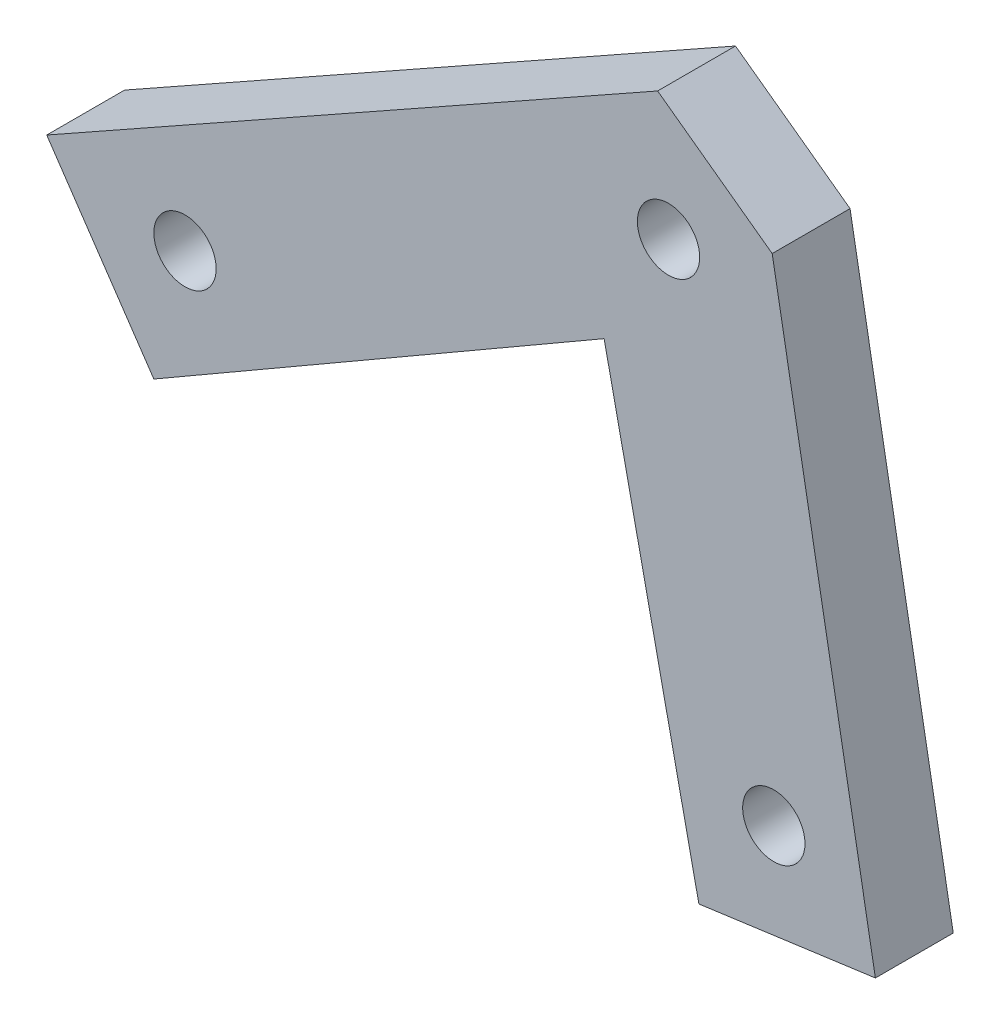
ISO-10303-21;
HEADER;
FILE_DESCRIPTION(('STEP AP214'),'2;1');
FILE_NAME('part.step','',(''),(''),'','','');
FILE_SCHEMA(('AUTOMOTIVE_DESIGN { 1 0 10303 214 1 1 1 1 }'));
ENDSEC;
DATA;
#1=APPLICATION_CONTEXT('core data for automotive mechanical design processes');
#2=APPLICATION_PROTOCOL_DEFINITION('international standard','automotive_design',2000,#1);
#3=PRODUCT_CONTEXT('',#1,'mechanical');
#4=PRODUCT('Part','Part','',(#3));
#5=PRODUCT_RELATED_PRODUCT_CATEGORY('part','',(#4));
#6=PRODUCT_DEFINITION_FORMATION('','',#4);
#7=PRODUCT_DEFINITION_CONTEXT('part definition',#1,'design');
#8=PRODUCT_DEFINITION('design','',#6,#7);
#9=PRODUCT_DEFINITION_SHAPE('','',#8);
#10=(LENGTH_UNIT() NAMED_UNIT(*) SI_UNIT(.MILLI.,.METRE.));
#11=(NAMED_UNIT(*) PLANE_ANGLE_UNIT() SI_UNIT($,.RADIAN.));
#12=(NAMED_UNIT(*) SI_UNIT($,.STERADIAN.) SOLID_ANGLE_UNIT());
#13=UNCERTAINTY_MEASURE_WITH_UNIT(LENGTH_MEASURE(1.E-05),#10,'distance_accuracy_value','');
#14=(GEOMETRIC_REPRESENTATION_CONTEXT(3) GLOBAL_UNCERTAINTY_ASSIGNED_CONTEXT((#13)) GLOBAL_UNIT_ASSIGNED_CONTEXT((#10,
#11,#12)) REPRESENTATION_CONTEXT('',''));
#15=CARTESIAN_POINT('',(0.,0.,0.));
#16=DIRECTION('',(0.,0.,1.));
#17=DIRECTION('',(1.,0.,0.));
#18=AXIS2_PLACEMENT_3D('',#15,#16,#17);
#19=CARTESIAN_POINT('',(0.,0.,6.35));
#20=DIRECTION('',(0.,0.,1.));
#21=DIRECTION('',(1.,0.,0.));
#22=AXIS2_PLACEMENT_3D('',#19,#20,#21);
#23=PLANE('',#22);
#24=CARTESIAN_POINT('',(12.9301314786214,13.5051717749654,6.35));
#25=DIRECTION('',(0.,0.,1.));
#26=DIRECTION('',(1.,0.,0.));
#27=AXIS2_PLACEMENT_3D('',#24,#25,#26);
#28=CIRCLE('',#27,2.54);
#29=CARTESIAN_POINT('',(15.4701314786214,13.5051717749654,6.35));
#30=VERTEX_POINT('',#29);
#31=EDGE_CURVE('E164',#30,#30,#28,.T.);
#32=ORIENTED_EDGE('',*,*,#31,.F.);
#33=EDGE_LOOP('',(#32));
#34=FACE_BOUND('',#33,.T.);
#35=DIRECTION('',(-0.871585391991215,-0.490243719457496,0.));
#36=VECTOR('',#35,1.);
#37=CARTESIAN_POINT('',(12.0429958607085,23.5374237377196,6.35));
#38=LINE('',#37,#36);
#39=CARTESIAN_POINT('',(12.0429958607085,23.5374237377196,6.35));
#40=VERTEX_POINT('',#39);
#41=CARTESIAN_POINT('',(-37.7708753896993,-4.48156068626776,6.35));
#42=VERTEX_POINT('',#41);
#43=EDGE_CURVE('E137',#40,#42,#38,.T.);
#44=ORIENTED_EDGE('',*,*,#43,.T.);
#45=DIRECTION('',(0.561707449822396,-0.827335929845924,0.));
#46=VECTOR('',#45,1.);
#47=CARTESIAN_POINT('',(-37.7708753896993,-4.48156068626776,6.35));
#48=LINE('',#47,#46);
#49=CARTESIAN_POINT('',(-29.0364554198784,-17.3464416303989,6.35));
#50=VERTEX_POINT('',#49);
#51=EDGE_CURVE('E90',#42,#50,#48,.T.);
#52=ORIENTED_EDGE('',*,*,#51,.T.);
#53=DIRECTION('',(0.865901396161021,0.500214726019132,0.));
#54=VECTOR('',#53,1.);
#55=CARTESIAN_POINT('',(-29.0364554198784,-17.3464416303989,6.35));
#56=LINE('',#55,#54);
#57=CARTESIAN_POINT('',(7.68011087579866,3.86401862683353,6.35));
#58=VERTEX_POINT('',#57);
#59=EDGE_CURVE('E149',#50,#58,#56,.T.);
#60=ORIENTED_EDGE('',*,*,#59,.T.);
#61=DIRECTION('',(0.209529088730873,-0.977802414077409,0.));
#62=VECTOR('',#61,1.);
#63=CARTESIAN_POINT('',(7.68011087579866,3.86401862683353,6.35));
#64=LINE('',#63,#62);
#65=CARTESIAN_POINT('',(15.4067785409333,-32.1937638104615,6.35));
#66=VERTEX_POINT('',#65);
#67=EDGE_CURVE('E106',#58,#66,#64,.T.);
#68=ORIENTED_EDGE('',*,*,#67,.T.);
#69=DIRECTION('',(0.990766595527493,0.135578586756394,0.));
#70=VECTOR('',#69,1.);
#71=CARTESIAN_POINT('',(15.4067785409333,-32.1937638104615,6.35));
#72=LINE('',#71,#70);
#73=CARTESIAN_POINT('',(29.799590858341,-30.2242210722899,6.35));
#74=VERTEX_POINT('',#73);
#75=EDGE_CURVE('E100',#66,#74,#72,.T.);
#76=ORIENTED_EDGE('',*,*,#75,.T.);
#77=DIRECTION('',(-0.176427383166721,0.984313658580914,0.));
#78=VECTOR('',#77,1.);
#79=CARTESIAN_POINT('',(29.799590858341,-30.2242210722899,6.35));
#80=LINE('',#79,#78);
#81=CARTESIAN_POINT('',(21.3841908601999,16.7265017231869,6.35));
#82=VERTEX_POINT('',#81);
#83=EDGE_CURVE('E104',#74,#82,#80,.T.);
#84=ORIENTED_EDGE('',*,*,#83,.T.);
#85=DIRECTION('',(-0.808022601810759,0.589151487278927,0.));
#86=VECTOR('',#85,1.);
#87=CARTESIAN_POINT('',(21.3841908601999,16.7265017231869,6.35));
#88=LINE('',#87,#86);
#89=EDGE_CURVE('E50',#82,#40,#88,.T.);
#90=ORIENTED_EDGE('',*,*,#89,.T.);
#91=EDGE_LOOP('',(#44,#52,#60,#68,#76,#84,#90));
#92=FACE_BOUND('',#91,.T.);
#93=CARTESIAN_POINT('',(-26.4964554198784,-7.02156068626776,6.35));
#94=DIRECTION('',(0.,0.,1.));
#95=DIRECTION('',(1.,0.,0.));
#96=AXIS2_PLACEMENT_3D('',#93,#94,#95);
#97=CIRCLE('',#96,2.54);
#98=CARTESIAN_POINT('',(-23.9564554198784,-7.02156068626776,6.35));
#99=VERTEX_POINT('',#98);
#100=EDGE_CURVE('E128',#99,#99,#97,.T.);
#101=ORIENTED_EDGE('',*,*,#100,.F.);
#102=EDGE_LOOP('',(#101));
#103=FACE_BOUND('',#102,.T.);
#104=CARTESIAN_POINT('',(21.5172256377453,-23.6145239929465,6.35));
#105=DIRECTION('',(0.,0.,1.));
#106=DIRECTION('',(1.,0.,0.));
#107=AXIS2_PLACEMENT_3D('',#104,#105,#106);
#108=CIRCLE('',#107,2.54);
#109=CARTESIAN_POINT('',(24.0572256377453,-23.6145239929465,6.35));
#110=VERTEX_POINT('',#109);
#111=EDGE_CURVE('E170',#110,#110,#108,.T.);
#112=ORIENTED_EDGE('',*,*,#111,.F.);
#113=EDGE_LOOP('',(#112));
#114=FACE_BOUND('',#113,.T.);
#115=ADVANCED_FACE('F33',(#34,#92,#103,#114),#23,.T.);
#116=CARTESIAN_POINT('',(0.,0.,0.));
#117=DIRECTION('',(0.,0.,1.));
#118=DIRECTION('',(1.,0.,0.));
#119=AXIS2_PLACEMENT_3D('',#116,#117,#118);
#120=PLANE('',#119);
#121=CARTESIAN_POINT('',(12.9301314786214,13.5051717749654,0.));
#122=DIRECTION('',(0.,0.,1.));
#123=DIRECTION('',(1.,0.,0.));
#124=AXIS2_PLACEMENT_3D('',#121,#122,#123);
#125=CIRCLE('',#124,2.54);
#126=CARTESIAN_POINT('',(15.4701314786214,13.5051717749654,0.));
#127=VERTEX_POINT('',#126);
#128=EDGE_CURVE('E167',#127,#127,#125,.T.);
#129=ORIENTED_EDGE('',*,*,#128,.T.);
#130=EDGE_LOOP('',(#129));
#131=FACE_BOUND('',#130,.T.);
#132=DIRECTION('',(-0.871585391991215,-0.490243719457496,0.));
#133=VECTOR('',#132,1.);
#134=CARTESIAN_POINT('',(12.0429958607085,23.5374237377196,0.));
#135=LINE('',#134,#133);
#136=CARTESIAN_POINT('',(12.0429958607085,23.5374237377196,0.));
#137=VERTEX_POINT('',#136);
#138=CARTESIAN_POINT('',(-37.7708753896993,-4.48156068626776,0.));
#139=VERTEX_POINT('',#138);
#140=EDGE_CURVE('E124',#137,#139,#135,.T.);
#141=ORIENTED_EDGE('',*,*,#140,.F.);
#142=DIRECTION('',(-0.808022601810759,0.589151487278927,0.));
#143=VECTOR('',#142,1.);
#144=CARTESIAN_POINT('',(21.3841908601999,16.7265017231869,0.));
#145=LINE('',#144,#143);
#146=CARTESIAN_POINT('',(21.3841908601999,16.7265017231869,0.));
#147=VERTEX_POINT('',#146);
#148=EDGE_CURVE('E82',#147,#137,#145,.T.);
#149=ORIENTED_EDGE('',*,*,#148,.F.);
#150=DIRECTION('',(-0.176427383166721,0.984313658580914,0.));
#151=VECTOR('',#150,1.);
#152=CARTESIAN_POINT('',(29.799590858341,-30.2242210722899,0.));
#153=LINE('',#152,#151);
#154=CARTESIAN_POINT('',(29.799590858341,-30.2242210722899,0.));
#155=VERTEX_POINT('',#154);
#156=EDGE_CURVE('E76',#155,#147,#153,.T.);
#157=ORIENTED_EDGE('',*,*,#156,.F.);
#158=DIRECTION('',(0.990766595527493,0.135578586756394,0.));
#159=VECTOR('',#158,1.);
#160=CARTESIAN_POINT('',(15.4067785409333,-32.1937638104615,0.));
#161=LINE('',#160,#159);
#162=CARTESIAN_POINT('',(15.4067785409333,-32.1937638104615,0.));
#163=VERTEX_POINT('',#162);
#164=EDGE_CURVE('E114',#163,#155,#161,.T.);
#165=ORIENTED_EDGE('',*,*,#164,.F.);
#166=DIRECTION('',(0.209529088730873,-0.977802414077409,0.));
#167=VECTOR('',#166,1.);
#168=CARTESIAN_POINT('',(7.68011087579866,3.86401862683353,0.));
#169=LINE('',#168,#167);
#170=CARTESIAN_POINT('',(7.68011087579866,3.86401862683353,0.));
#171=VERTEX_POINT('',#170);
#172=EDGE_CURVE('E132',#171,#163,#169,.T.);
#173=ORIENTED_EDGE('',*,*,#172,.F.);
#174=DIRECTION('',(0.865901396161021,0.500214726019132,0.));
#175=VECTOR('',#174,1.);
#176=CARTESIAN_POINT('',(-29.0364554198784,-17.3464416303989,0.));
#177=LINE('',#176,#175);
#178=CARTESIAN_POINT('',(-29.0364554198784,-17.3464416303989,0.));
#179=VERTEX_POINT('',#178);
#180=EDGE_CURVE('E130',#179,#171,#177,.T.);
#181=ORIENTED_EDGE('',*,*,#180,.F.);
#182=DIRECTION('',(0.561707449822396,-0.827335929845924,0.));
#183=VECTOR('',#182,1.);
#184=CARTESIAN_POINT('',(-37.7708753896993,-4.48156068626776,0.));
#185=LINE('',#184,#183);
#186=EDGE_CURVE('E127',#139,#179,#185,.T.);
#187=ORIENTED_EDGE('',*,*,#186,.F.);
#188=EDGE_LOOP('',(#141,#149,#157,#165,#173,#181,#187));
#189=FACE_BOUND('',#188,.T.);
#190=CARTESIAN_POINT('',(-26.4964554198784,-7.02156068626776,0.));
#191=DIRECTION('',(0.,0.,1.));
#192=DIRECTION('',(1.,0.,0.));
#193=AXIS2_PLACEMENT_3D('',#190,#191,#192);
#194=CIRCLE('',#193,2.54);
#195=CARTESIAN_POINT('',(-23.9564554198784,-7.02156068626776,0.));
#196=VERTEX_POINT('',#195);
#197=EDGE_CURVE('E161',#196,#196,#194,.T.);
#198=ORIENTED_EDGE('',*,*,#197,.T.);
#199=EDGE_LOOP('',(#198));
#200=FACE_BOUND('',#199,.T.);
#201=CARTESIAN_POINT('',(21.5172256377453,-23.6145239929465,0.));
#202=DIRECTION('',(0.,0.,1.));
#203=DIRECTION('',(1.,0.,0.));
#204=AXIS2_PLACEMENT_3D('',#201,#202,#203);
#205=CIRCLE('',#204,2.54);
#206=CARTESIAN_POINT('',(24.0572256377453,-23.6145239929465,0.));
#207=VERTEX_POINT('',#206);
#208=EDGE_CURVE('E173',#207,#207,#205,.T.);
#209=ORIENTED_EDGE('',*,*,#208,.T.);
#210=EDGE_LOOP('',(#209));
#211=FACE_BOUND('',#210,.T.);
#212=ADVANCED_FACE('F153',(#131,#189,#200,#211),#120,.F.);
#213=CARTESIAN_POINT('',(12.0429958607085,23.5374237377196,6.35));
#214=DIRECTION('',(0.490243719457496,-0.871585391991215,0.));
#215=DIRECTION('',(0.871585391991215,0.490243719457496,0.));
#216=AXIS2_PLACEMENT_3D('',#213,#214,#215);
#217=PLANE('',#216);
#218=ORIENTED_EDGE('',*,*,#140,.T.);
#219=DIRECTION('',(0.,0.,-1.));
#220=VECTOR('',#219,1.);
#221=CARTESIAN_POINT('',(-37.7708753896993,-4.48156068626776,6.35));
#222=LINE('',#221,#220);
#223=EDGE_CURVE('E11',#42,#139,#222,.T.);
#224=ORIENTED_EDGE('',*,*,#223,.F.);
#225=ORIENTED_EDGE('',*,*,#43,.F.);
#226=DIRECTION('',(0.,0.,-1.));
#227=VECTOR('',#226,1.);
#228=CARTESIAN_POINT('',(12.0429958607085,23.5374237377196,6.35));
#229=LINE('',#228,#227);
#230=EDGE_CURVE('E120',#40,#137,#229,.T.);
#231=ORIENTED_EDGE('',*,*,#230,.T.);
#232=EDGE_LOOP('',(#218,#224,#225,#231));
#233=FACE_BOUND('',#232,.T.);
#234=ADVANCED_FACE('F35',(#233),#217,.F.);
#235=CARTESIAN_POINT('',(-37.7708753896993,-4.48156068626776,6.35));
#236=DIRECTION('',(0.827335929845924,0.561707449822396,0.));
#237=DIRECTION('',(-0.561707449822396,0.827335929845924,0.));
#238=AXIS2_PLACEMENT_3D('',#235,#236,#237);
#239=PLANE('',#238);
#240=ORIENTED_EDGE('',*,*,#186,.T.);
#241=DIRECTION('',(0.,0.,-1.));
#242=VECTOR('',#241,1.);
#243=CARTESIAN_POINT('',(-29.0364554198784,-17.3464416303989,6.35));
#244=LINE('',#243,#242);
#245=EDGE_CURVE('E42',#50,#179,#244,.T.);
#246=ORIENTED_EDGE('',*,*,#245,.F.);
#247=ORIENTED_EDGE('',*,*,#51,.F.);
#248=ORIENTED_EDGE('',*,*,#223,.T.);
#249=EDGE_LOOP('',(#240,#246,#247,#248));
#250=FACE_BOUND('',#249,.T.);
#251=ADVANCED_FACE('F205',(#250),#239,.F.);
#252=CARTESIAN_POINT('',(-29.0364554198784,-17.3464416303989,6.35));
#253=DIRECTION('',(-0.500214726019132,0.865901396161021,0.));
#254=DIRECTION('',(-0.865901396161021,-0.500214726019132,0.));
#255=AXIS2_PLACEMENT_3D('',#252,#253,#254);
#256=PLANE('',#255);
#257=ORIENTED_EDGE('',*,*,#180,.T.);
#258=DIRECTION('',(0.,0.,-1.));
#259=VECTOR('',#258,1.);
#260=CARTESIAN_POINT('',(7.68011087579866,3.86401862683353,6.35));
#261=LINE('',#260,#259);
#262=EDGE_CURVE('E141',#58,#171,#261,.T.);
#263=ORIENTED_EDGE('',*,*,#262,.F.);
#264=ORIENTED_EDGE('',*,*,#59,.F.);
#265=ORIENTED_EDGE('',*,*,#245,.T.);
#266=EDGE_LOOP('',(#257,#263,#264,#265));
#267=FACE_BOUND('',#266,.T.);
#268=ADVANCED_FACE('F147',(#267),#256,.F.);
#269=CARTESIAN_POINT('',(7.68011087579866,3.86401862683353,6.35));
#270=DIRECTION('',(0.97780241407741,0.209529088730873,0.));
#271=DIRECTION('',(-0.209529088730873,0.97780241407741,0.));
#272=AXIS2_PLACEMENT_3D('',#269,#270,#271);
#273=PLANE('',#272);
#274=ORIENTED_EDGE('',*,*,#172,.T.);
#275=DIRECTION('',(0.,0.,-1.));
#276=VECTOR('',#275,1.);
#277=CARTESIAN_POINT('',(15.4067785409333,-32.1937638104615,6.35));
#278=LINE('',#277,#276);
#279=EDGE_CURVE('E115',#66,#163,#278,.T.);
#280=ORIENTED_EDGE('',*,*,#279,.F.);
#281=ORIENTED_EDGE('',*,*,#67,.F.);
#282=ORIENTED_EDGE('',*,*,#262,.T.);
#283=EDGE_LOOP('',(#274,#280,#281,#282));
#284=FACE_BOUND('',#283,.T.);
#285=ADVANCED_FACE('F156',(#284),#273,.F.);
#286=CARTESIAN_POINT('',(15.4067785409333,-32.1937638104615,6.35));
#287=DIRECTION('',(-0.135578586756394,0.990766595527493,0.));
#288=DIRECTION('',(-0.990766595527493,-0.135578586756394,0.));
#289=AXIS2_PLACEMENT_3D('',#286,#287,#288);
#290=PLANE('',#289);
#291=ORIENTED_EDGE('',*,*,#164,.T.);
#292=DIRECTION('',(0.,0.,-1.));
#293=VECTOR('',#292,1.);
#294=CARTESIAN_POINT('',(29.799590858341,-30.2242210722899,6.35));
#295=LINE('',#294,#293);
#296=EDGE_CURVE('E111',#74,#155,#295,.T.);
#297=ORIENTED_EDGE('',*,*,#296,.F.);
#298=ORIENTED_EDGE('',*,*,#75,.F.);
#299=ORIENTED_EDGE('',*,*,#279,.T.);
#300=EDGE_LOOP('',(#291,#297,#298,#299));
#301=FACE_BOUND('',#300,.T.);
#302=ADVANCED_FACE('F112',(#301),#290,.F.);
#303=CARTESIAN_POINT('',(29.799590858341,-30.2242210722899,6.35));
#304=DIRECTION('',(-0.984313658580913,-0.176427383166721,0.));
#305=DIRECTION('',(0.176427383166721,-0.984313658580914,0.));
#306=AXIS2_PLACEMENT_3D('',#303,#304,#305);
#307=PLANE('',#306);
#308=ORIENTED_EDGE('',*,*,#156,.T.);
#309=DIRECTION('',(0.,0.,-1.));
#310=VECTOR('',#309,1.);
#311=CARTESIAN_POINT('',(21.3841908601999,16.7265017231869,6.35));
#312=LINE('',#311,#310);
#313=EDGE_CURVE('E116',#82,#147,#312,.T.);
#314=ORIENTED_EDGE('',*,*,#313,.F.);
#315=ORIENTED_EDGE('',*,*,#83,.F.);
#316=ORIENTED_EDGE('',*,*,#296,.T.);
#317=EDGE_LOOP('',(#308,#314,#315,#316));
#318=FACE_BOUND('',#317,.T.);
#319=ADVANCED_FACE('F118',(#318),#307,.F.);
#320=CARTESIAN_POINT('',(21.3841908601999,16.7265017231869,6.35));
#321=DIRECTION('',(-0.589151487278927,-0.808022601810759,0.));
#322=DIRECTION('',(0.808022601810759,-0.589151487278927,0.));
#323=AXIS2_PLACEMENT_3D('',#320,#321,#322);
#324=PLANE('',#323);
#325=ORIENTED_EDGE('',*,*,#148,.T.);
#326=ORIENTED_EDGE('',*,*,#230,.F.);
#327=ORIENTED_EDGE('',*,*,#89,.F.);
#328=ORIENTED_EDGE('',*,*,#313,.T.);
#329=EDGE_LOOP('',(#325,#326,#327,#328));
#330=FACE_BOUND('',#329,.T.);
#331=ADVANCED_FACE('F195',(#330),#324,.F.);
#332=CARTESIAN_POINT('',(-26.4964554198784,-7.02156068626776,6.35));
#333=DIRECTION('',(0.,0.,-1.));
#334=DIRECTION('',(-1.,0.,0.));
#335=AXIS2_PLACEMENT_3D('',#332,#333,#334);
#336=CYLINDRICAL_SURFACE('',#335,2.54);
#337=ORIENTED_EDGE('',*,*,#100,.T.);
#338=EDGE_LOOP('',(#337));
#339=FACE_BOUND('',#338,.T.);
#340=ORIENTED_EDGE('',*,*,#197,.F.);
#341=EDGE_LOOP('',(#340));
#342=FACE_BOUND('',#341,.T.);
#343=ADVANCED_FACE('F192',(#339,#342),#336,.F.);
#344=CARTESIAN_POINT('',(12.9301314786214,13.5051717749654,6.35));
#345=DIRECTION('',(0.,0.,-1.));
#346=DIRECTION('',(-1.,0.,0.));
#347=AXIS2_PLACEMENT_3D('',#344,#345,#346);
#348=CYLINDRICAL_SURFACE('',#347,2.54);
#349=ORIENTED_EDGE('',*,*,#31,.T.);
#350=EDGE_LOOP('',(#349));
#351=FACE_BOUND('',#350,.T.);
#352=ORIENTED_EDGE('',*,*,#128,.F.);
#353=EDGE_LOOP('',(#352));
#354=FACE_BOUND('',#353,.T.);
#355=ADVANCED_FACE('F264',(#351,#354),#348,.F.);
#356=CARTESIAN_POINT('',(21.5172256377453,-23.6145239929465,6.35));
#357=DIRECTION('',(0.,0.,-1.));
#358=DIRECTION('',(-1.,0.,0.));
#359=AXIS2_PLACEMENT_3D('',#356,#357,#358);
#360=CYLINDRICAL_SURFACE('',#359,2.54);
#361=ORIENTED_EDGE('',*,*,#111,.T.);
#362=EDGE_LOOP('',(#361));
#363=FACE_BOUND('',#362,.T.);
#364=ORIENTED_EDGE('',*,*,#208,.F.);
#365=EDGE_LOOP('',(#364));
#366=FACE_BOUND('',#365,.T.);
#367=ADVANCED_FACE('F179',(#363,#366),#360,.F.);
#368=CLOSED_SHELL('',(#115,#212,#234,#251,#268,#285,#302,#319,#331,#343,#355,#367));
#369=MANIFOLD_SOLID_BREP('B2',#368);
#370=ADVANCED_BREP_SHAPE_REPRESENTATION('',(#18,#369),#14);
#371=SHAPE_DEFINITION_REPRESENTATION(#9,#370);
ENDSEC;
END-ISO-10303-21;
